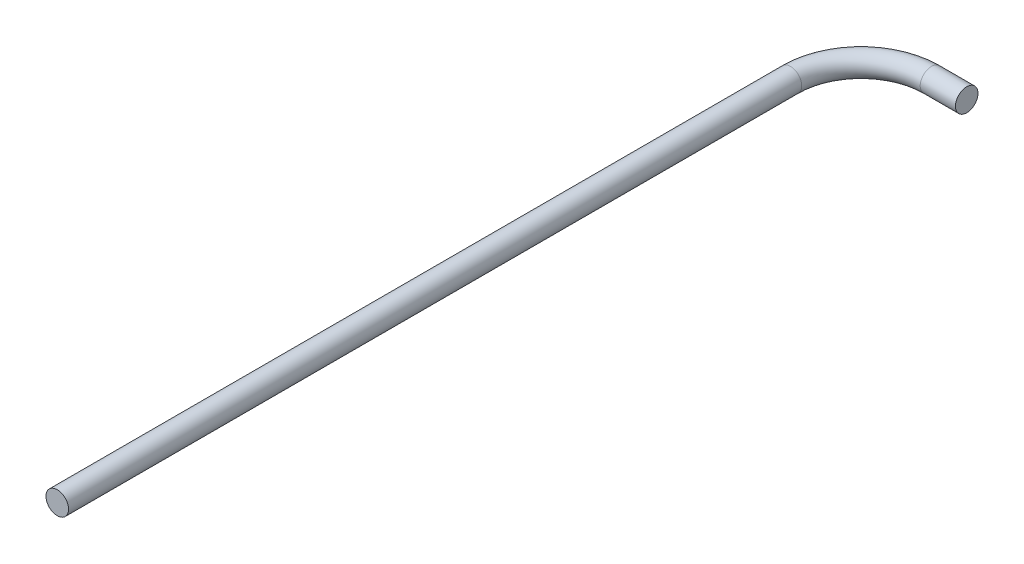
from build123d import *

# Parameters (mm, degrees)
SKETCH1_R = 0.8


with BuildPart() as part:
    # Sweep1: sweep along a path in Sketch2
    with BuildLine(Plane(origin=(0, 0, 0), x_dir=(1, 0, 0), z_dir=(0, 1, 0))) as sweep1_path:
        Line((0, 0), (0, 52))
        ThreePointArc((0, 52), (1.464466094, 55.535533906), (5, 57))
        Line((5, 57), (7.5, 57))
    # Sketch1 → Sweep1 (sweep)
    with BuildSketch(Plane.XY):
        Circle(SKETCH1_R)
    sweep(path=sweep1_path.line)


solid = part.part
